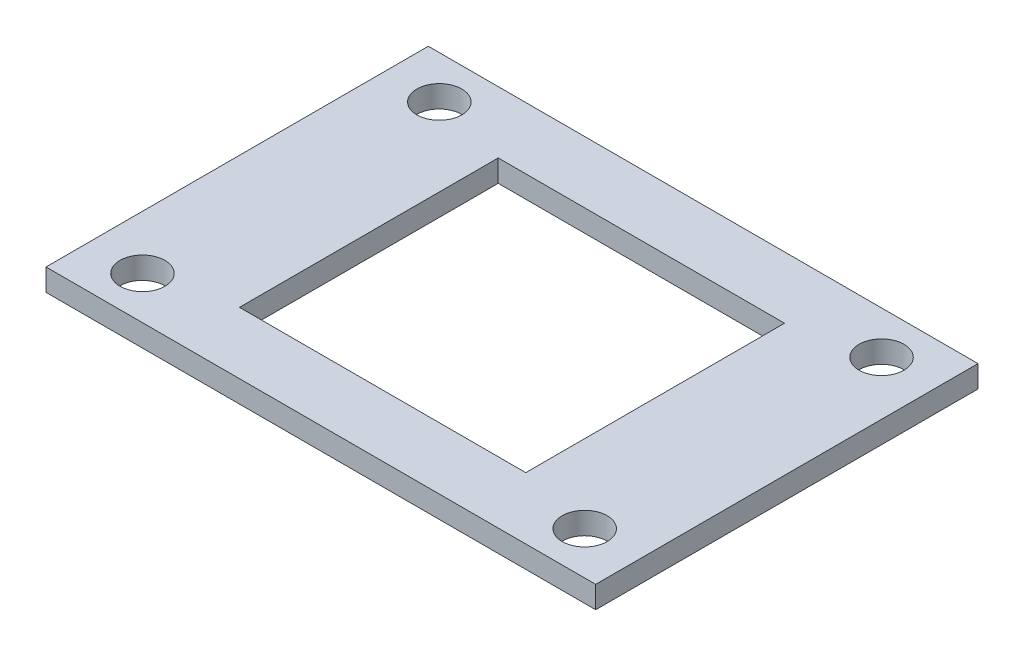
from build123d import *

# Parameters (mm, degrees)
SKETCH1_W           = 24.96
SKETCH1_H           = 17.36
BOSS_EXTRUDE1_DEPTH = 1
SKETCH2_W           = 13
SKETCH2_H           = 11.75
CUT_EXTRUDE1_DEPTH  = 31.41991453
SKETCH3_R           = 1.02
CUT_EXTRUDE2_DEPTH  = 31.41991453


with BuildPart() as part:
    # Sketch1 → Boss-Extrude1 (new body)
    with BuildSketch(Plane(origin=(0, 0, 0), x_dir=(1, 0, 0), z_dir=(0, 1, 0))):
        with Locations((12.48, -8.68)):
            Rectangle(SKETCH1_W, SKETCH1_H)
    extrude(amount=-BOSS_EXTRUDE1_DEPTH)

    # Sketch2 → Cut-Extrude1 (cut, through all)
    with BuildSketch(Plane(origin=(0, 0, 0), x_dir=(1, 0, 0), z_dir=(0, 1, 0))):
        with Locations((12.48, -8.68)):
            Rectangle(SKETCH2_W, SKETCH2_H)
    extrude(amount=-CUT_EXTRUDE1_DEPTH, mode=Mode.SUBTRACT)

    # Sketch3 → Cut-Extrude2 (cut, through all)
    with BuildSketch(Plane(origin=(0, 0, 0), x_dir=(1, 0, 0), z_dir=(0, 1, 0))):
        with Locations(Location((2.44, -1.94, 0), (0, 0, 270))):
            Circle(SKETCH3_R)
        with Locations(Location((22.52, -1.94, 0), (0, 0, 270))):
            Circle(SKETCH3_R)
        with Locations(Location((22.52, -15.42, 0), (0, 0, 270))):
            Circle(SKETCH3_R)
        with Locations(Location((2.44, -15.42, 0), (0, 0, 270))):
            Circle(SKETCH3_R)
    extrude(amount=-CUT_EXTRUDE2_DEPTH, mode=Mode.SUBTRACT)


solid = part.part
